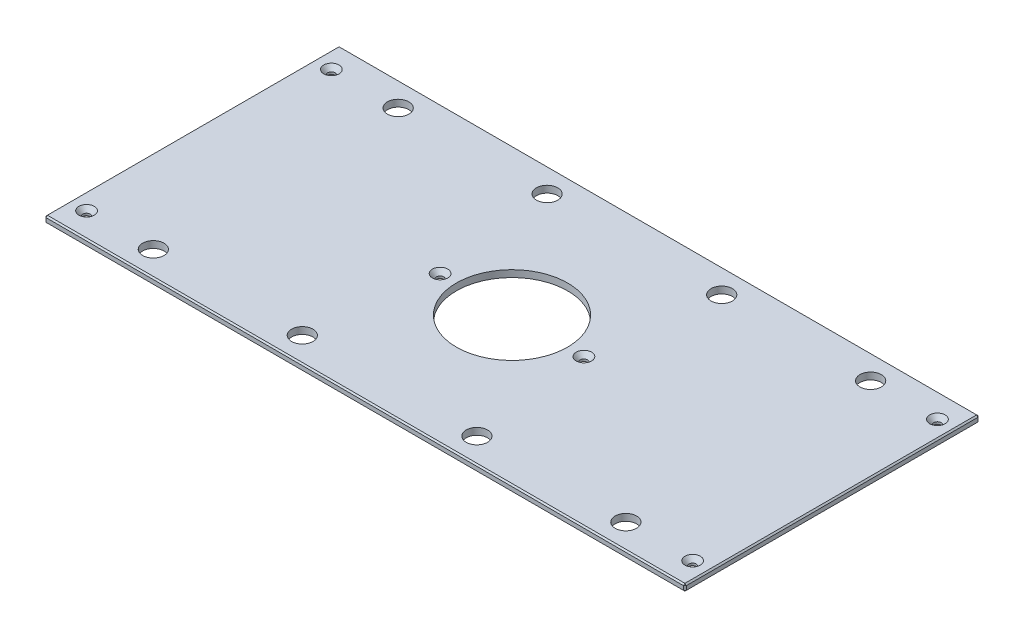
from build123d import *

# Parameters (mm, degrees)
SKETCH1_W                                     = 593.725
SKETCH1_H                                     = 273.05
BOSS_EXTRUDE1_DEPTH                           = 6.35
SKETCH13_R                                    = 51.562
CUT_EXTRUDE6_DEPTH                            = 327.813007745
F_25_32_0_78125_DIAMETER_HOLE1_D              = 19.84375
CHAMFER2_SIZE                                 = 1.27
CSK_FOR_1_4_FLAT_HEAD_MACHINE_SCREW1_AT_COUNT = 2
CSK_FOR_1_4_FLAT_HEAD_MACHINE_SCREW1_AT_PITCH = 227.00996
CSK_FOR_1_4_FLAT_HEAD_MACHINE_SCREW1_2_COUNT  = 2
CSK_FOR_1_4_FLAT_HEAD_MACHINE_SCREW1_2_PITCH  = 606.093575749
CSK_FOR_1_4_FLAT_HEAD_MACHINE_SCREW1_3_COUNT  = 2
CSK_FOR_1_4_FLAT_HEAD_MACHINE_SCREW1_3_PITCH  = 365.722017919
CSK_FOR_1_4_FLAT_HEAD_MACHINE_SCREW1_4_COUNT  = 2
CSK_FOR_1_4_FLAT_HEAD_MACHINE_SCREW1_4_PITCH  = 242.514387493
CSK_FOR_1_4_FLAT_HEAD_MACHINE_SCREW1_5_COUNT  = 2
CSK_FOR_1_4_FLAT_HEAD_MACHINE_SCREW1_5_PITCH  = 561.975
CSK_FOR_1_4_FLAT_HEAD_MACHINE_SCREW1_6_COUNT  = 2
CSK_FOR_1_4_FLAT_HEAD_MACHINE_SCREW1_6_PITCH  = 500.0625
CSK_FOR_1_4_FLAT_HEAD_MACHINE_SCREW1_7_COUNT  = 2
CSK_FOR_1_4_FLAT_HEAD_MACHINE_SCREW1_7_PITCH  = 549.177590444


with BuildPart() as part:
    # Sketch1 → Boss-Extrude1 (new body)
    with BuildSketch(Plane(origin=(0, 0, 0), x_dir=(1, 0, 0), z_dir=(0, 1, 0))):
        Rectangle(SKETCH1_W, SKETCH1_H)
    extrude(amount=BOSS_EXTRUDE1_DEPTH)

    # Sketch13 → Cut-Extrude6 (cut, through all)
    with BuildSketch(Plane(origin=(0, 6.35, 0), x_dir=(1, 0, 0), z_dir=(0, 1, 0))):
        with Locations(Location((0, 0, 0), (0, 0, 270))):
            Circle(SKETCH13_R)
    extrude(amount=-CUT_EXTRUDE6_DEPTH, mode=Mode.SUBTRACT)

    # 25_32 _0.78125_ Diameter Hole1 (through all)
    with Locations(Plane(origin=(0, 6.35, 0), x_dir=(1, 0, 0), z_dir=(0, 1, 0))):
        with Locations((219.075, 113.50498), (-219.075, 113.50498), (219.075, -113.50498), (-219.075, -113.50498), (-80.9625, 113.50498), (80.9625, 113.50498), (80.9625, -113.50498), (-80.9625, -113.50498)):
            Hole(F_25_32_0_78125_DIAMETER_HOLE1_D / 2)

    # Chamfer2
    chamfer2_edges = [part.edges().sort_by_distance(p)[0] for p in [
        (296.8625, 6.35, 0),
        (0, 6.35, -136.525),
        (-296.8625, 6.35, 0),
        (0, 0, -136.525),
        (296.8625, 0, 0),
        (0, 0, 136.525),
        (-296.8625, 0, 0),
        (0, 6.35, 136.525),
        (-296.8625, 3.175, -136.525),
        (296.8625, 3.175, -136.525),
        (296.8625, 3.175, 136.525),
        (-296.8625, 3.175, 136.525),
    ]]
    chamfer(chamfer2_edges, length=CHAMFER2_SIZE)

    # Sketch24 → CSK for 1_4 Flat Head Machine Screw1 (revolve, cut)
    with BuildSketch(Plane(origin=(280.9875, 6.35, -113.50498), x_dir=(0, 0, 1), z_dir=(1, 0, 0))):
        Polygon((0, 0), (0, 6.35), (3.3782, 6.35), (3.3782, 4.324464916), (7.1374, 0), align=None)
    csk_for_1_4_flat_head_machine_screw1 = revolve(axis=Axis((280.9875, 12.7, -113.50498), (0, -1, 0)), mode=Mode.SUBTRACT)

    # CSK for 1_4 Flat Head Machine Screw1 at: CSK for 1_4 Flat Head Machine Screw1 ×2
    with Locations(*[(0, 0, i * CSK_FOR_1_4_FLAT_HEAD_MACHINE_SCREW1_AT_PITCH) for i in range(1, CSK_FOR_1_4_FLAT_HEAD_MACHINE_SCREW1_AT_COUNT)]):
        add(csk_for_1_4_flat_head_machine_screw1, mode=Mode.SUBTRACT)

    # CSK for 1_4 Flat Head Machine Screw1 2: CSK for 1_4 Flat Head Machine Screw1 ×2
    with Locations(*[Vector(-0.9272083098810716, 0, 0.3745460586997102) * (i * CSK_FOR_1_4_FLAT_HEAD_MACHINE_SCREW1_2_PITCH) for i in range(1, CSK_FOR_1_4_FLAT_HEAD_MACHINE_SCREW1_2_COUNT)]):
        add(csk_for_1_4_flat_head_machine_screw1, mode=Mode.SUBTRACT)

    # CSK for 1_4 Flat Head Machine Screw1 3: CSK for 1_4 Flat Head Machine Screw1 ×2
    with Locations(*[Vector(-0.9506195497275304, 0, 0.310358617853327) * (i * CSK_FOR_1_4_FLAT_HEAD_MACHINE_SCREW1_3_PITCH) for i in range(1, CSK_FOR_1_4_FLAT_HEAD_MACHINE_SCREW1_3_COUNT)]):
        add(csk_for_1_4_flat_head_machine_screw1, mode=Mode.SUBTRACT)

    # CSK for 1_4 Flat Head Machine Screw1 4: CSK for 1_4 Flat Head Machine Screw1 ×2
    with Locations(*[Vector(-0.8837104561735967, 0, 0.4680340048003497) * (i * CSK_FOR_1_4_FLAT_HEAD_MACHINE_SCREW1_4_PITCH) for i in range(1, CSK_FOR_1_4_FLAT_HEAD_MACHINE_SCREW1_4_COUNT)]):
        add(csk_for_1_4_flat_head_machine_screw1, mode=Mode.SUBTRACT)

    # CSK for 1_4 Flat Head Machine Screw1 5: CSK for 1_4 Flat Head Machine Screw1 ×2
    with Locations(*[(-i * CSK_FOR_1_4_FLAT_HEAD_MACHINE_SCREW1_5_PITCH, 0, 0) for i in range(1, CSK_FOR_1_4_FLAT_HEAD_MACHINE_SCREW1_5_COUNT)]):
        add(csk_for_1_4_flat_head_machine_screw1, mode=Mode.SUBTRACT)

    # CSK for 1_4 Flat Head Machine Screw1 6: CSK for 1_4 Flat Head Machine Screw1 ×2
    with Locations(*[(-i * CSK_FOR_1_4_FLAT_HEAD_MACHINE_SCREW1_6_PITCH, 0, 0) for i in range(1, CSK_FOR_1_4_FLAT_HEAD_MACHINE_SCREW1_6_COUNT)]):
        add(csk_for_1_4_flat_head_machine_screw1, mode=Mode.SUBTRACT)

    # CSK for 1_4 Flat Head Machine Screw1 7: CSK for 1_4 Flat Head Machine Screw1 ×2
    with Locations(*[Vector(-0.9105661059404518, 0, 0.41336348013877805) * (i * CSK_FOR_1_4_FLAT_HEAD_MACHINE_SCREW1_7_PITCH) for i in range(1, CSK_FOR_1_4_FLAT_HEAD_MACHINE_SCREW1_7_COUNT)]):
        add(csk_for_1_4_flat_head_machine_screw1, mode=Mode.SUBTRACT)


solid = part.part
